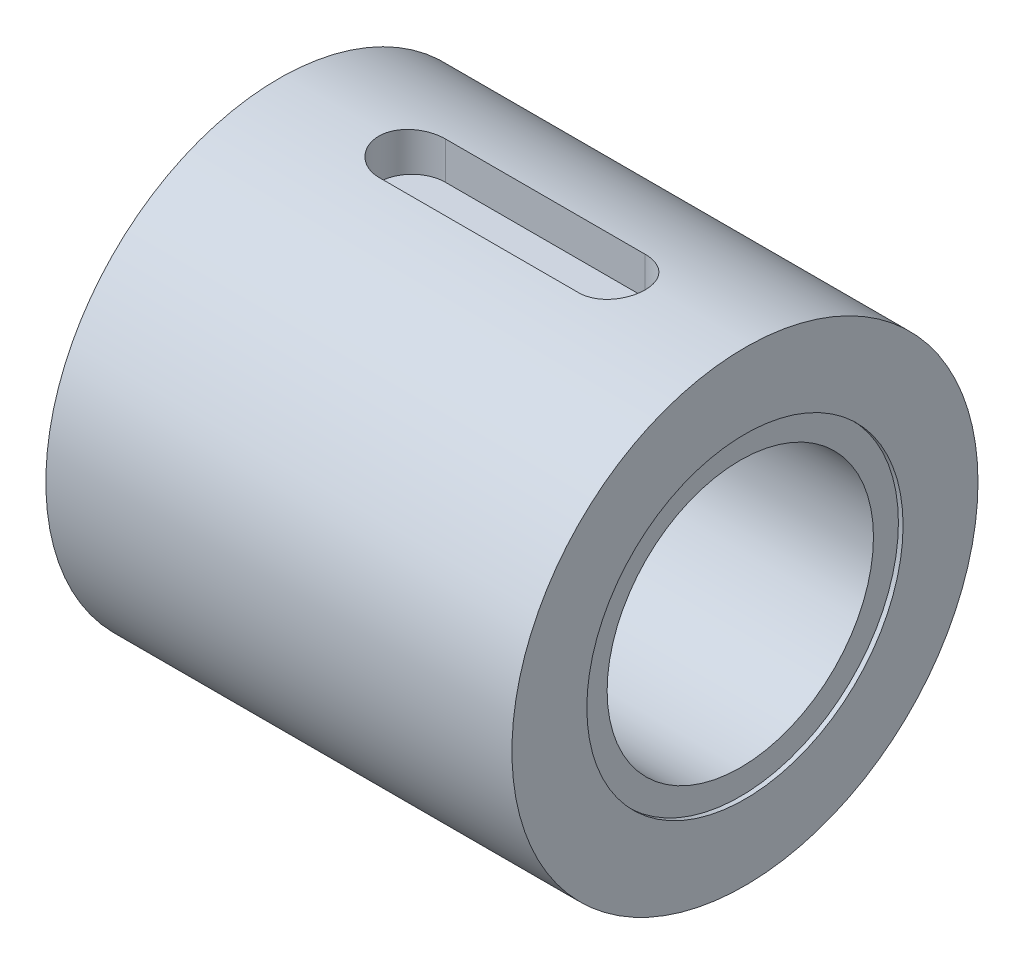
ISO-10303-21;
HEADER;
FILE_DESCRIPTION(('STEP AP214'),'2;1');
FILE_NAME('part.step','',(''),(''),'','','');
FILE_SCHEMA(('AUTOMOTIVE_DESIGN { 1 0 10303 214 1 1 1 1 }'));
ENDSEC;
DATA;
#1=APPLICATION_CONTEXT('core data for automotive mechanical design processes');
#2=APPLICATION_PROTOCOL_DEFINITION('international standard','automotive_design',2000,#1);
#3=PRODUCT_CONTEXT('',#1,'mechanical');
#4=PRODUCT('Part','Part','',(#3));
#5=PRODUCT_RELATED_PRODUCT_CATEGORY('part','',(#4));
#6=PRODUCT_DEFINITION_FORMATION('','',#4);
#7=PRODUCT_DEFINITION_CONTEXT('part definition',#1,'design');
#8=PRODUCT_DEFINITION('design','',#6,#7);
#9=PRODUCT_DEFINITION_SHAPE('','',#8);
#10=(LENGTH_UNIT() NAMED_UNIT(*) SI_UNIT(.MILLI.,.METRE.));
#11=(NAMED_UNIT(*) PLANE_ANGLE_UNIT() SI_UNIT($,.RADIAN.));
#12=(NAMED_UNIT(*) SI_UNIT($,.STERADIAN.) SOLID_ANGLE_UNIT());
#13=UNCERTAINTY_MEASURE_WITH_UNIT(LENGTH_MEASURE(1.E-05),#10,'distance_accuracy_value','');
#14=(GEOMETRIC_REPRESENTATION_CONTEXT(3) GLOBAL_UNCERTAINTY_ASSIGNED_CONTEXT((#13)) GLOBAL_UNIT_ASSIGNED_CONTEXT((#10,
#11,#12)) REPRESENTATION_CONTEXT('',''));
#15=CARTESIAN_POINT('',(0.,0.,0.));
#16=DIRECTION('',(0.,0.,1.));
#17=DIRECTION('',(1.,0.,0.));
#18=AXIS2_PLACEMENT_3D('',#15,#16,#17);
#19=CARTESIAN_POINT('',(14.,0.,0.));
#20=DIRECTION('',(-1.,0.,0.));
#21=DIRECTION('',(0.,0.,1.));
#22=AXIS2_PLACEMENT_3D('',#19,#20,#21);
#23=CYLINDRICAL_SURFACE('',#22,4.);
#24=CARTESIAN_POINT('',(13.86,0.,0.));
#25=DIRECTION('',(1.,0.,0.));
#26=DIRECTION('',(0.,0.,-1.));
#27=AXIS2_PLACEMENT_3D('',#24,#25,#26);
#28=CIRCLE('',#27,4.);
#29=CARTESIAN_POINT('',(13.86,0.,-4.));
#30=VERTEX_POINT('',#29);
#31=EDGE_CURVE('E117',#30,#30,#28,.T.);
#32=ORIENTED_EDGE('',*,*,#31,.T.);
#33=EDGE_LOOP('',(#32));
#34=FACE_BOUND('',#33,.T.);
#35=CARTESIAN_POINT('',(0.140000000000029,0.,0.));
#36=DIRECTION('',(-1.,0.,0.));
#37=DIRECTION('',(0.,0.,1.));
#38=AXIS2_PLACEMENT_3D('',#35,#36,#37);
#39=CIRCLE('',#38,4.);
#40=CARTESIAN_POINT('',(0.140000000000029,0.,4.));
#41=VERTEX_POINT('',#40);
#42=EDGE_CURVE('E107',#41,#41,#39,.T.);
#43=ORIENTED_EDGE('',*,*,#42,.T.);
#44=EDGE_LOOP('',(#43));
#45=FACE_BOUND('',#44,.T.);
#46=ADVANCED_FACE('F40',(#34,#45),#23,.F.);
#47=CARTESIAN_POINT('',(14.,0.,0.));
#48=DIRECTION('',(1.,0.,0.));
#49=DIRECTION('',(0.,0.,-1.));
#50=AXIS2_PLACEMENT_3D('',#47,#48,#49);
#51=PLANE('',#50);
#52=CARTESIAN_POINT('',(14.,0.,0.));
#53=DIRECTION('',(1.,0.,0.));
#54=DIRECTION('',(0.,0.,-1.));
#55=AXIS2_PLACEMENT_3D('',#52,#53,#54);
#56=CIRCLE('',#55,4.7495);
#57=CARTESIAN_POINT('',(14.,0.,-4.7495));
#58=VERTEX_POINT('',#57);
#59=EDGE_CURVE('E122',#58,#58,#56,.T.);
#60=ORIENTED_EDGE('',*,*,#59,.F.);
#61=EDGE_LOOP('',(#60));
#62=FACE_BOUND('',#61,.T.);
#63=CARTESIAN_POINT('',(14.,0.,0.));
#64=DIRECTION('',(1.,0.,0.));
#65=DIRECTION('',(0.,0.,-1.));
#66=AXIS2_PLACEMENT_3D('',#63,#64,#65);
#67=CIRCLE('',#66,7.);
#68=CARTESIAN_POINT('',(14.,0.,-7.));
#69=VERTEX_POINT('',#68);
#70=EDGE_CURVE('E129',#69,#69,#67,.T.);
#71=ORIENTED_EDGE('',*,*,#70,.T.);
#72=EDGE_LOOP('',(#71));
#73=FACE_BOUND('',#72,.T.);
#74=ADVANCED_FACE('F177',(#62,#73),#51,.T.);
#75=CARTESIAN_POINT('',(0.,0.,0.));
#76=DIRECTION('',(1.,0.,0.));
#77=DIRECTION('',(0.,0.,-1.));
#78=AXIS2_PLACEMENT_3D('',#75,#76,#77);
#79=PLANE('',#78);
#80=CARTESIAN_POINT('',(0.,0.,0.));
#81=DIRECTION('',(-1.,0.,0.));
#82=DIRECTION('',(0.,0.,1.));
#83=AXIS2_PLACEMENT_3D('',#80,#81,#82);
#84=CIRCLE('',#83,4.7495);
#85=CARTESIAN_POINT('',(0.,0.,4.7495));
#86=VERTEX_POINT('',#85);
#87=EDGE_CURVE('E113',#86,#86,#84,.T.);
#88=ORIENTED_EDGE('',*,*,#87,.F.);
#89=EDGE_LOOP('',(#88));
#90=FACE_BOUND('',#89,.T.);
#91=CARTESIAN_POINT('',(0.,0.,0.));
#92=DIRECTION('',(1.,0.,0.));
#93=DIRECTION('',(0.,0.,-1.));
#94=AXIS2_PLACEMENT_3D('',#91,#92,#93);
#95=CIRCLE('',#94,7.);
#96=CARTESIAN_POINT('',(0.,0.,-7.));
#97=VERTEX_POINT('',#96);
#98=EDGE_CURVE('E126',#97,#97,#95,.T.);
#99=ORIENTED_EDGE('',*,*,#98,.F.);
#100=EDGE_LOOP('',(#99));
#101=FACE_BOUND('',#100,.T.);
#102=ADVANCED_FACE('F180',(#90,#101),#79,.F.);
#103=CARTESIAN_POINT('',(14.,0.,0.));
#104=DIRECTION('',(-1.,0.,0.));
#105=DIRECTION('',(0.,0.,1.));
#106=AXIS2_PLACEMENT_3D('',#103,#104,#105);
#107=CYLINDRICAL_SURFACE('',#106,7.);
#108=DIRECTION('',(-1.,0.,0.));
#109=VECTOR('',#108,1.);
#110=CARTESIAN_POINT('',(14.,6.92820323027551,1.00000000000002));
#111=LINE('',#110,#109);
#112=CARTESIAN_POINT('',(10.,6.92820323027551,1.00000000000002));
#113=VERTEX_POINT('',#112);
#114=CARTESIAN_POINT('',(4.,6.92820323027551,1.00000000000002));
#115=VERTEX_POINT('',#114);
#116=EDGE_CURVE('E11',#113,#115,#111,.T.);
#117=ORIENTED_EDGE('',*,*,#116,.T.);
#118=CARTESIAN_POINT('',(4.,6.92820323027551,1.00000000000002));
#119=CARTESIAN_POINT('',(3.97201882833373,6.92820224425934,0.999999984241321));
#120=CARTESIAN_POINT('',(3.94405120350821,6.92837295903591,0.998824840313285));
#121=CARTESIAN_POINT('',(3.88831891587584,6.92904742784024,0.994137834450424));
#122=CARTESIAN_POINT('',(3.86055423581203,6.92955115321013,0.990626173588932));
#123=CARTESIAN_POINT('',(3.77793207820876,6.93154367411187,0.976625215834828));
#124=CARTESIAN_POINT('',(3.72363252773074,6.93351389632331,0.962669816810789));
#125=CARTESIAN_POINT('',(3.61817866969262,6.93851596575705,0.925924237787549));
#126=CARTESIAN_POINT('',(3.56702526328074,6.94154811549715,0.903131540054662));
#127=CARTESIAN_POINT('',(3.46926269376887,6.94833096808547,0.84936927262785));
#128=CARTESIAN_POINT('',(3.42265333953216,6.95208164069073,0.818400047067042));
#129=CARTESIAN_POINT('',(3.33497732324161,6.95990892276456,0.748928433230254));
#130=CARTESIAN_POINT('',(3.29394803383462,6.96398746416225,0.710379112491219));
#131=CARTESIAN_POINT('',(3.21891280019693,6.9719941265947,0.626938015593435));
#132=CARTESIAN_POINT('',(3.18490792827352,6.97592222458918,0.582045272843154));
#133=CARTESIAN_POINT('',(3.12475451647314,6.98320529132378,0.486953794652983));
#134=CARTESIAN_POINT('',(3.09864060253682,6.98655770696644,0.436732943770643));
#135=CARTESIAN_POINT('',(3.05523363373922,6.99228989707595,0.332565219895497));
#136=CARTESIAN_POINT('',(3.03793964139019,6.99466977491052,0.278618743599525));
#137=CARTESIAN_POINT('',(3.01277554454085,6.99817522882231,0.168917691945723));
#138=CARTESIAN_POINT('',(3.0048421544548,6.99930922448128,0.113177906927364));
#139=CARTESIAN_POINT('',(2.99842801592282,7.00022398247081,0.0011461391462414));
#140=CARTESIAN_POINT('',(2.99994701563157,7.00000478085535,-0.0551458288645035));
#141=CARTESIAN_POINT('',(3.01234470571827,6.99824454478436,-0.166249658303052));
#142=CARTESIAN_POINT('',(3.02315505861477,6.99671316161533,-0.22106931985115));
#143=CARTESIAN_POINT('',(3.05372139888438,6.99251141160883,-0.328108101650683));
#144=CARTESIAN_POINT('',(3.07347754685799,6.98984102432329,-0.380327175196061));
#145=CARTESIAN_POINT('',(3.1214458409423,6.98364463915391,-0.480891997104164));
#146=CARTESIAN_POINT('',(3.1496871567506,6.98011569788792,-0.52922364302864));
#147=CARTESIAN_POINT('',(3.2138017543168,6.97259617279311,-0.620485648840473));
#148=CARTESIAN_POINT('',(3.24967518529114,6.96860557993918,-0.663415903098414));
#149=CARTESIAN_POINT('',(3.32841140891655,6.96056660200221,-0.743055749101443));
#150=CARTESIAN_POINT('',(3.37133291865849,6.95651801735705,-0.779707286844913));
#151=CARTESIAN_POINT('',(3.46276412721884,6.94885251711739,-0.845306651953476));
#152=CARTESIAN_POINT('',(3.51127545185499,6.94523572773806,-0.874252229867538));
#153=CARTESIAN_POINT('',(3.61257371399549,6.93884293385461,-0.9236242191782));
#154=CARTESIAN_POINT('',(3.66536587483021,6.93606797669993,-0.944040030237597));
#155=CARTESIAN_POINT('',(3.77364063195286,6.93169008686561,-0.975669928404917));
#156=CARTESIAN_POINT('',(3.82911905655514,6.93008539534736,-0.986897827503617));
#157=CARTESIAN_POINT('',(3.90417145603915,6.92883929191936,-0.995584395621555));
#158=CARTESIAN_POINT('',(3.9233159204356,6.92860095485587,-0.997240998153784));
#159=CARTESIAN_POINT('',(3.96163751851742,6.92828310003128,-0.999447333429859));
#160=CARTESIAN_POINT('',(3.98081454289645,6.92820331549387,-0.999998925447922));
#161=CARTESIAN_POINT('',(4.,6.92820323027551,-0.99999999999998));
#162=B_SPLINE_CURVE_WITH_KNOTS('',3,(#118,#119,#120,#121,#122,#123,#124,#125,#126,#127,#128,
#129,#130,#131,#132,#133,#134,#135,#136,#137,#138,#139,#140,#141,#142,#143,#144,#145,#146,#147,
#148,#149,#150,#151,#152,#153,#154,#155,#156,#157,#158,#159,#160,#161),.UNSPECIFIED.,.F.,.F.,(4,
2,2,2,2,2,2,2,2,2,2,2,2,2,2,2,2,2,2,2,2,4),(0.,0.0838915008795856,0.16777578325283,
0.33520686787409,0.502685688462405,0.670157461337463,0.838700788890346,1.00726982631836,
1.1765681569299,1.34584848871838,1.51397766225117,1.68210235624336,1.84900098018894,
2.0159026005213,2.18338467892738,2.35087003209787,2.51982895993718,2.68883715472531,
2.85805476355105,3.02701752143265,3.08464600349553,3.14217743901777),.UNSPECIFIED.);
#163=CARTESIAN_POINT('',(4.,6.92820323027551,-0.999999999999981));
#164=VERTEX_POINT('',#163);
#165=EDGE_CURVE('E132',#115,#164,#162,.T.);
#166=ORIENTED_EDGE('',*,*,#165,.T.);
#167=DIRECTION('',(-1.,0.,0.));
#168=VECTOR('',#167,1.);
#169=CARTESIAN_POINT('',(14.,6.92820323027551,-0.999999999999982));
#170=LINE('',#169,#168);
#171=CARTESIAN_POINT('',(10.,6.92820323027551,-0.999999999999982));
#172=VERTEX_POINT('',#171);
#173=EDGE_CURVE('E49',#164,#172,#170,.F.);
#174=ORIENTED_EDGE('',*,*,#173,.T.);
#175=CARTESIAN_POINT('',(10.,6.92820323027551,-0.999999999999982));
#176=CARTESIAN_POINT('',(10.0279811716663,6.92820224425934,-0.999999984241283));
#177=CARTESIAN_POINT('',(10.0559487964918,6.92837295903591,-0.998824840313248));
#178=CARTESIAN_POINT('',(10.1116810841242,6.92904742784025,-0.994137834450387));
#179=CARTESIAN_POINT('',(10.139445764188,6.92955115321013,-0.990626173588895));
#180=CARTESIAN_POINT('',(10.2220679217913,6.93154367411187,-0.976625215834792));
#181=CARTESIAN_POINT('',(10.2763674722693,6.9335138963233,-0.962669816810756));
#182=CARTESIAN_POINT('',(10.3818213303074,6.93851596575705,-0.925924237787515));
#183=CARTESIAN_POINT('',(10.4329747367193,6.94154811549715,-0.903131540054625));
#184=CARTESIAN_POINT('',(10.5307373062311,6.94833096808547,-0.849369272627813));
#185=CARTESIAN_POINT('',(10.5773466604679,6.95208164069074,-0.818400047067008));
#186=CARTESIAN_POINT('',(10.6650226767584,6.95990892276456,-0.74892843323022));
#187=CARTESIAN_POINT('',(10.7060519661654,6.96398746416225,-0.710379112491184));
#188=CARTESIAN_POINT('',(10.7810871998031,6.9719941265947,-0.626938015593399));
#189=CARTESIAN_POINT('',(10.8150920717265,6.97592222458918,-0.582045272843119));
#190=CARTESIAN_POINT('',(10.8752454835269,6.98320529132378,-0.486953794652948));
#191=CARTESIAN_POINT('',(10.9013593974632,6.98655770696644,-0.436732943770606));
#192=CARTESIAN_POINT('',(10.9447663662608,6.99228989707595,-0.332565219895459));
#193=CARTESIAN_POINT('',(10.9620603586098,6.99466977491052,-0.278618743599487));
#194=CARTESIAN_POINT('',(10.9872244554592,6.99817522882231,-0.168917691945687));
#195=CARTESIAN_POINT('',(10.9951578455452,6.99930922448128,-0.113177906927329));
#196=CARTESIAN_POINT('',(11.0015719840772,7.00022398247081,-0.00114613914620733));
#197=CARTESIAN_POINT('',(11.0000529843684,7.00000478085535,0.0551458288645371));
#198=CARTESIAN_POINT('',(10.9876552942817,6.99824454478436,0.166249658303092));
#199=CARTESIAN_POINT('',(10.9768449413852,6.99671316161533,0.221069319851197));
#200=CARTESIAN_POINT('',(10.9462786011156,6.99251141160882,0.32810810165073));
#201=CARTESIAN_POINT('',(10.926522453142,6.98984102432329,0.380327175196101));
#202=CARTESIAN_POINT('',(10.8785541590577,6.98364463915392,0.480891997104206));
#203=CARTESIAN_POINT('',(10.8503128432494,6.98011569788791,0.529223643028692));
#204=CARTESIAN_POINT('',(10.7861982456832,6.9725961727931,0.620485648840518));
#205=CARTESIAN_POINT('',(10.7503248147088,6.96860557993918,0.663415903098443));
#206=CARTESIAN_POINT('',(10.6715885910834,6.96056660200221,0.743055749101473));
#207=CARTESIAN_POINT('',(10.6286670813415,6.95651801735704,0.779707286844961));
#208=CARTESIAN_POINT('',(10.5372358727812,6.94885251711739,0.845306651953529));
#209=CARTESIAN_POINT('',(10.488724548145,6.94523572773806,0.874252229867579));
#210=CARTESIAN_POINT('',(10.3874262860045,6.93884293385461,0.923624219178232));
#211=CARTESIAN_POINT('',(10.3346341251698,6.93606797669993,0.944040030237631));
#212=CARTESIAN_POINT('',(10.2263593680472,6.93169008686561,0.975669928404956));
#213=CARTESIAN_POINT('',(10.1708809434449,6.93008539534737,0.986897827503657));
#214=CARTESIAN_POINT('',(10.0958285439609,6.92883929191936,0.995584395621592));
#215=CARTESIAN_POINT('',(10.0766840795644,6.92860095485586,0.997240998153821));
#216=CARTESIAN_POINT('',(10.0383624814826,6.92828310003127,0.999447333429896));
#217=CARTESIAN_POINT('',(10.0191854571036,6.92820331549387,0.999998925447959));
#218=CARTESIAN_POINT('',(10.,6.92820323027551,1.00000000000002));
#219=B_SPLINE_CURVE_WITH_KNOTS('',3,(#175,#176,#177,#178,#179,#180,#181,#182,#183,#184,#185,
#186,#187,#188,#189,#190,#191,#192,#193,#194,#195,#196,#197,#198,#199,#200,#201,#202,#203,#204,
#205,#206,#207,#208,#209,#210,#211,#212,#213,#214,#215,#216,#217,#218),.UNSPECIFIED.,.F.,.F.,(4,
2,2,2,2,2,2,2,2,2,2,2,2,2,2,2,2,2,2,2,2,4),(0.,0.0838915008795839,0.167775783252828,
0.335206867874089,0.502685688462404,0.670157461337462,0.838700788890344,1.00726982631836,
1.1765681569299,1.34584848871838,1.51397766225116,1.68210235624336,1.84900098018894,
2.01590260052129,2.18338467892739,2.3508700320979,2.51982895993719,2.68883715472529,
2.85805476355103,3.02701752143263,3.08464600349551,3.14217743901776),.UNSPECIFIED.);
#220=EDGE_CURVE('E56',#172,#113,#219,.T.);
#221=ORIENTED_EDGE('',*,*,#220,.T.);
#222=EDGE_LOOP('',(#117,#166,#174,#221));
#223=FACE_BOUND('',#222,.T.);
#224=ORIENTED_EDGE('',*,*,#70,.F.);
#225=EDGE_LOOP('',(#224));
#226=FACE_BOUND('',#225,.T.);
#227=ORIENTED_EDGE('',*,*,#98,.T.);
#228=EDGE_LOOP('',(#227));
#229=FACE_BOUND('',#228,.T.);
#230=ADVANCED_FACE('F42',(#223,#226,#229),#107,.T.);
#231=CARTESIAN_POINT('',(13.86,0.,0.));
#232=DIRECTION('',(1.,0.,0.));
#233=DIRECTION('',(0.,0.,-1.));
#234=AXIS2_PLACEMENT_3D('',#231,#232,#233);
#235=CYLINDRICAL_SURFACE('',#234,4.7495);
#236=CARTESIAN_POINT('',(13.86,0.,0.));
#237=DIRECTION('',(1.,0.,0.));
#238=DIRECTION('',(0.,0.,-1.));
#239=AXIS2_PLACEMENT_3D('',#236,#237,#238);
#240=CIRCLE('',#239,4.7495);
#241=CARTESIAN_POINT('',(13.86,0.,-4.7495));
#242=VERTEX_POINT('',#241);
#243=EDGE_CURVE('E123',#242,#242,#240,.T.);
#244=ORIENTED_EDGE('',*,*,#243,.F.);
#245=EDGE_LOOP('',(#244));
#246=FACE_BOUND('',#245,.T.);
#247=ORIENTED_EDGE('',*,*,#59,.T.);
#248=EDGE_LOOP('',(#247));
#249=FACE_BOUND('',#248,.T.);
#250=ADVANCED_FACE('F170',(#246,#249),#235,.F.);
#251=CARTESIAN_POINT('',(13.86,0.,0.));
#252=DIRECTION('',(1.,0.,0.));
#253=DIRECTION('',(0.,0.,-1.));
#254=AXIS2_PLACEMENT_3D('',#251,#252,#253);
#255=PLANE('',#254);
#256=ORIENTED_EDGE('',*,*,#31,.F.);
#257=EDGE_LOOP('',(#256));
#258=FACE_BOUND('',#257,.T.);
#259=ORIENTED_EDGE('',*,*,#243,.T.);
#260=EDGE_LOOP('',(#259));
#261=FACE_BOUND('',#260,.T.);
#262=ADVANCED_FACE('F166',(#258,#261),#255,.T.);
#263=CARTESIAN_POINT('',(0.140000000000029,0.,0.));
#264=DIRECTION('',(-1.,0.,0.));
#265=DIRECTION('',(0.,0.,1.));
#266=AXIS2_PLACEMENT_3D('',#263,#264,#265);
#267=CYLINDRICAL_SURFACE('',#266,4.7495);
#268=CARTESIAN_POINT('',(0.140000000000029,0.,0.));
#269=DIRECTION('',(-1.,0.,0.));
#270=DIRECTION('',(0.,0.,1.));
#271=AXIS2_PLACEMENT_3D('',#268,#269,#270);
#272=CIRCLE('',#271,4.7495);
#273=CARTESIAN_POINT('',(0.140000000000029,0.,4.7495));
#274=VERTEX_POINT('',#273);
#275=EDGE_CURVE('E114',#274,#274,#272,.T.);
#276=ORIENTED_EDGE('',*,*,#275,.F.);
#277=EDGE_LOOP('',(#276));
#278=FACE_BOUND('',#277,.T.);
#279=ORIENTED_EDGE('',*,*,#87,.T.);
#280=EDGE_LOOP('',(#279));
#281=FACE_BOUND('',#280,.T.);
#282=ADVANCED_FACE('F162',(#278,#281),#267,.F.);
#283=CARTESIAN_POINT('',(0.140000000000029,0.,0.));
#284=DIRECTION('',(-1.,0.,0.));
#285=DIRECTION('',(0.,0.,1.));
#286=AXIS2_PLACEMENT_3D('',#283,#284,#285);
#287=PLANE('',#286);
#288=ORIENTED_EDGE('',*,*,#42,.F.);
#289=EDGE_LOOP('',(#288));
#290=FACE_BOUND('',#289,.T.);
#291=ORIENTED_EDGE('',*,*,#275,.T.);
#292=EDGE_LOOP('',(#291));
#293=FACE_BOUND('',#292,.T.);
#294=ADVANCED_FACE('F159',(#290,#293),#287,.T.);
#295=CARTESIAN_POINT('',(10.,5.8,0.));
#296=DIRECTION('',(0.,1.,0.));
#297=DIRECTION('',(0.,0.,1.));
#298=AXIS2_PLACEMENT_3D('',#295,#296,#297);
#299=CYLINDRICAL_SURFACE('',#298,1.);
#300=DIRECTION('',(0.,1.,0.));
#301=VECTOR('',#300,1.);
#302=CARTESIAN_POINT('',(10.,5.8,-0.999999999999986));
#303=LINE('',#302,#301);
#304=CARTESIAN_POINT('',(10.,5.8,-0.999999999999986));
#305=VERTEX_POINT('',#304);
#306=EDGE_CURVE('E79',#305,#172,#303,.T.);
#307=ORIENTED_EDGE('',*,*,#306,.F.);
#308=CARTESIAN_POINT('',(10.,5.8,0.));
#309=DIRECTION('',(0.,1.,0.));
#310=DIRECTION('',(0.,0.,1.));
#311=AXIS2_PLACEMENT_3D('',#308,#309,#310);
#312=CIRCLE('',#311,1.);
#313=CARTESIAN_POINT('',(10.,5.8,1.00000000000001));
#314=VERTEX_POINT('',#313);
#315=EDGE_CURVE('E83',#314,#305,#312,.T.);
#316=ORIENTED_EDGE('',*,*,#315,.F.);
#317=DIRECTION('',(0.,1.,0.));
#318=VECTOR('',#317,1.);
#319=CARTESIAN_POINT('',(10.,5.8,1.00000000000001));
#320=LINE('',#319,#318);
#321=EDGE_CURVE('E105',#314,#113,#320,.T.);
#322=ORIENTED_EDGE('',*,*,#321,.T.);
#323=ORIENTED_EDGE('',*,*,#220,.F.);
#324=EDGE_LOOP('',(#307,#316,#322,#323));
#325=FACE_BOUND('',#324,.T.);
#326=ADVANCED_FACE('F81',(#325),#299,.F.);
#327=CARTESIAN_POINT('',(4.,5.8,1.00000000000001));
#328=DIRECTION('',(0.,0.,1.));
#329=DIRECTION('',(1.,0.,0.));
#330=AXIS2_PLACEMENT_3D('',#327,#328,#329);
#331=PLANE('',#330);
#332=ORIENTED_EDGE('',*,*,#321,.F.);
#333=DIRECTION('',(1.,0.,0.));
#334=VECTOR('',#333,1.);
#335=CARTESIAN_POINT('',(4.,5.8,1.00000000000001));
#336=LINE('',#335,#334);
#337=CARTESIAN_POINT('',(4.,5.8,1.00000000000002));
#338=VERTEX_POINT('',#337);
#339=EDGE_CURVE('E88',#338,#314,#336,.T.);
#340=ORIENTED_EDGE('',*,*,#339,.F.);
#341=DIRECTION('',(0.,1.,0.));
#342=VECTOR('',#341,1.);
#343=CARTESIAN_POINT('',(4.,5.8,1.00000000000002));
#344=LINE('',#343,#342);
#345=EDGE_CURVE('E108',#338,#115,#344,.T.);
#346=ORIENTED_EDGE('',*,*,#345,.T.);
#347=ORIENTED_EDGE('',*,*,#116,.F.);
#348=EDGE_LOOP('',(#332,#340,#346,#347));
#349=FACE_BOUND('',#348,.T.);
#350=ADVANCED_FACE('F152',(#349),#331,.F.);
#351=CARTESIAN_POINT('',(4.,5.8,0.));
#352=DIRECTION('',(0.,1.,0.));
#353=DIRECTION('',(0.,0.,1.));
#354=AXIS2_PLACEMENT_3D('',#351,#352,#353);
#355=CYLINDRICAL_SURFACE('',#354,1.);
#356=ORIENTED_EDGE('',*,*,#345,.F.);
#357=CARTESIAN_POINT('',(4.,5.8,0.));
#358=DIRECTION('',(0.,1.,0.));
#359=DIRECTION('',(0.,0.,1.));
#360=AXIS2_PLACEMENT_3D('',#357,#358,#359);
#361=CIRCLE('',#360,1.);
#362=CARTESIAN_POINT('',(4.,5.8,-0.999999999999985));
#363=VERTEX_POINT('',#362);
#364=EDGE_CURVE('E97',#363,#338,#361,.T.);
#365=ORIENTED_EDGE('',*,*,#364,.F.);
#366=DIRECTION('',(0.,1.,0.));
#367=VECTOR('',#366,1.);
#368=CARTESIAN_POINT('',(4.,5.8,-0.999999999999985));
#369=LINE('',#368,#367);
#370=EDGE_CURVE('E87',#363,#164,#369,.T.);
#371=ORIENTED_EDGE('',*,*,#370,.T.);
#372=ORIENTED_EDGE('',*,*,#165,.F.);
#373=EDGE_LOOP('',(#356,#365,#371,#372));
#374=FACE_BOUND('',#373,.T.);
#375=ADVANCED_FACE('F147',(#374),#355,.F.);
#376=CARTESIAN_POINT('',(10.,5.8,-0.999999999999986));
#377=DIRECTION('',(0.,0.,-1.));
#378=DIRECTION('',(-1.,0.,0.));
#379=AXIS2_PLACEMENT_3D('',#376,#377,#378);
#380=PLANE('',#379);
#381=ORIENTED_EDGE('',*,*,#370,.F.);
#382=DIRECTION('',(-1.,0.,0.));
#383=VECTOR('',#382,1.);
#384=CARTESIAN_POINT('',(10.,5.8,-0.999999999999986));
#385=LINE('',#384,#383);
#386=EDGE_CURVE('E91',#305,#363,#385,.T.);
#387=ORIENTED_EDGE('',*,*,#386,.F.);
#388=ORIENTED_EDGE('',*,*,#306,.T.);
#389=ORIENTED_EDGE('',*,*,#173,.F.);
#390=EDGE_LOOP('',(#381,#387,#388,#389));
#391=FACE_BOUND('',#390,.T.);
#392=ADVANCED_FACE('F92',(#391),#380,.F.);
#393=CARTESIAN_POINT('',(10.,5.8,0.));
#394=DIRECTION('',(0.,1.,0.));
#395=DIRECTION('',(0.,0.,1.));
#396=AXIS2_PLACEMENT_3D('',#393,#394,#395);
#397=PLANE('',#396);
#398=ORIENTED_EDGE('',*,*,#315,.T.);
#399=ORIENTED_EDGE('',*,*,#386,.T.);
#400=ORIENTED_EDGE('',*,*,#364,.T.);
#401=ORIENTED_EDGE('',*,*,#339,.T.);
#402=EDGE_LOOP('',(#398,#399,#400,#401));
#403=FACE_BOUND('',#402,.T.);
#404=ADVANCED_FACE('F99',(#403),#397,.T.);
#405=CLOSED_SHELL('',(#46,#74,#102,#230,#250,#262,#282,#294,#326,#350,#375,#392,#404));
#406=MANIFOLD_SOLID_BREP('B2',#405);
#407=ADVANCED_BREP_SHAPE_REPRESENTATION('',(#18,#406),#14);
#408=SHAPE_DEFINITION_REPRESENTATION(#9,#407);
ENDSEC;
END-ISO-10303-21;
